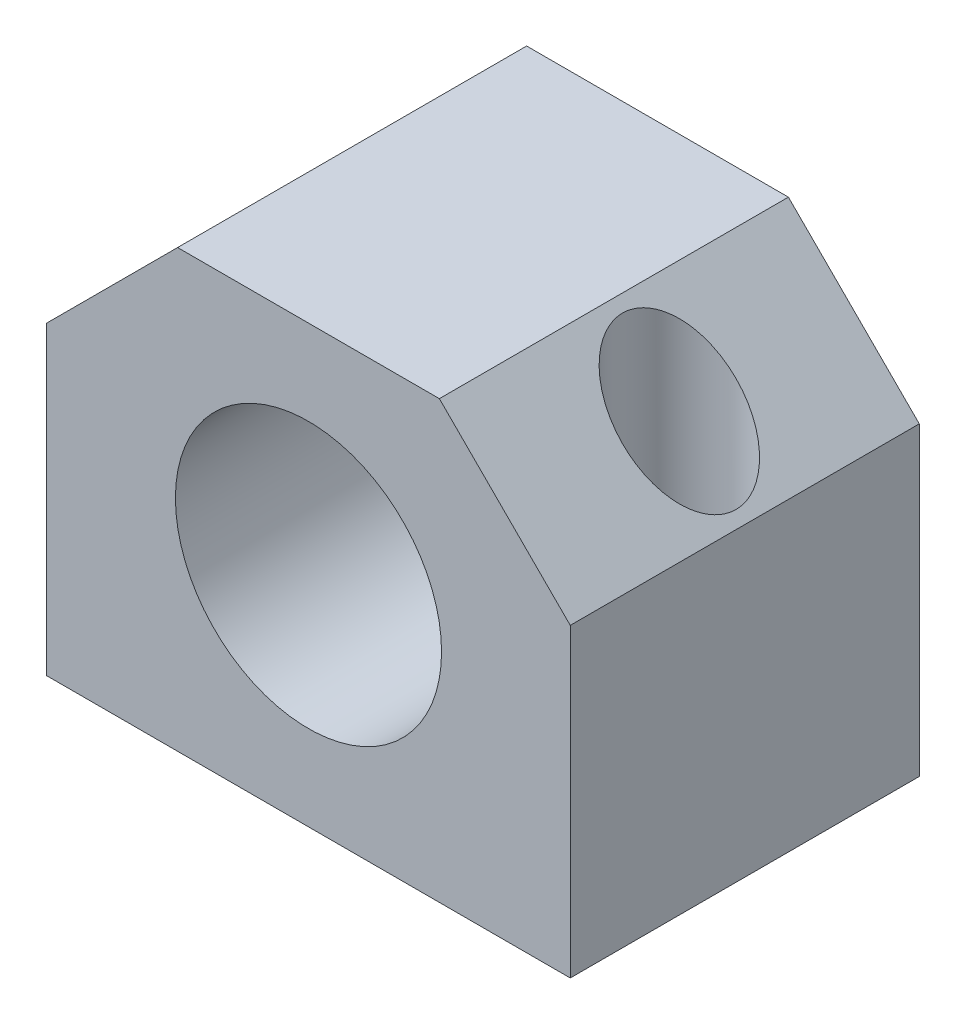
ISO-10303-21;
HEADER;
FILE_DESCRIPTION(('STEP AP214'),'2;1');
FILE_NAME('part.step','',(''),(''),'','','');
FILE_SCHEMA(('AUTOMOTIVE_DESIGN { 1 0 10303 214 1 1 1 1 }'));
ENDSEC;
DATA;
#1=APPLICATION_CONTEXT('core data for automotive mechanical design processes');
#2=APPLICATION_PROTOCOL_DEFINITION('international standard','automotive_design',2000,#1);
#3=PRODUCT_CONTEXT('',#1,'mechanical');
#4=PRODUCT('Part','Part','',(#3));
#5=PRODUCT_RELATED_PRODUCT_CATEGORY('part','',(#4));
#6=PRODUCT_DEFINITION_FORMATION('','',#4);
#7=PRODUCT_DEFINITION_CONTEXT('part definition',#1,'design');
#8=PRODUCT_DEFINITION('design','',#6,#7);
#9=PRODUCT_DEFINITION_SHAPE('','',#8);
#10=(LENGTH_UNIT() NAMED_UNIT(*) SI_UNIT(.MILLI.,.METRE.));
#11=(NAMED_UNIT(*) PLANE_ANGLE_UNIT() SI_UNIT($,.RADIAN.));
#12=(NAMED_UNIT(*) SI_UNIT($,.STERADIAN.) SOLID_ANGLE_UNIT());
#13=UNCERTAINTY_MEASURE_WITH_UNIT(LENGTH_MEASURE(1.E-05),#10,'distance_accuracy_value','');
#14=(GEOMETRIC_REPRESENTATION_CONTEXT(3) GLOBAL_UNCERTAINTY_ASSIGNED_CONTEXT((#13)) GLOBAL_UNIT_ASSIGNED_CONTEXT((#10,
#11,#12)) REPRESENTATION_CONTEXT('',''));
#15=CARTESIAN_POINT('',(0.,0.,0.));
#16=DIRECTION('',(0.,0.,1.));
#17=DIRECTION('',(1.,0.,0.));
#18=AXIS2_PLACEMENT_3D('',#15,#16,#17);
#19=CARTESIAN_POINT('',(-30.,-25.,40.));
#20=DIRECTION('',(0.,0.,1.));
#21=DIRECTION('',(1.,0.,0.));
#22=AXIS2_PLACEMENT_3D('',#19,#20,#21);
#23=PLANE('',#22);
#24=DIRECTION('',(0.,-1.,0.));
#25=VECTOR('',#24,1.);
#26=CARTESIAN_POINT('',(-30.,10.0000000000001,40.));
#27=LINE('',#26,#25);
#28=CARTESIAN_POINT('',(-30.,10.0000000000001,40.));
#29=VERTEX_POINT('',#28);
#30=CARTESIAN_POINT('',(-30.,-25.,40.));
#31=VERTEX_POINT('',#30);
#32=EDGE_CURVE('E128',#29,#31,#27,.T.);
#33=ORIENTED_EDGE('',*,*,#32,.T.);
#34=DIRECTION('',(1.,0.,0.));
#35=VECTOR('',#34,1.);
#36=CARTESIAN_POINT('',(-30.,-25.,40.));
#37=LINE('',#36,#35);
#38=CARTESIAN_POINT('',(30.,-25.,40.));
#39=VERTEX_POINT('',#38);
#40=EDGE_CURVE('E86',#31,#39,#37,.T.);
#41=ORIENTED_EDGE('',*,*,#40,.T.);
#42=DIRECTION('',(0.,1.,0.));
#43=VECTOR('',#42,1.);
#44=CARTESIAN_POINT('',(30.,-25.,40.));
#45=LINE('',#44,#43);
#46=CARTESIAN_POINT('',(30.,10.0000000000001,40.));
#47=VERTEX_POINT('',#46);
#48=EDGE_CURVE('E99',#39,#47,#45,.T.);
#49=ORIENTED_EDGE('',*,*,#48,.T.);
#50=DIRECTION('',(-0.707106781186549,0.707106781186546,0.));
#51=VECTOR('',#50,1.);
#52=CARTESIAN_POINT('',(30.,10.0000000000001,40.));
#53=LINE('',#52,#51);
#54=CARTESIAN_POINT('',(15.,25.,40.));
#55=VERTEX_POINT('',#54);
#56=EDGE_CURVE('E93',#47,#55,#53,.T.);
#57=ORIENTED_EDGE('',*,*,#56,.T.);
#58=DIRECTION('',(-1.,0.,0.));
#59=VECTOR('',#58,1.);
#60=CARTESIAN_POINT('',(15.,25.,40.));
#61=LINE('',#60,#59);
#62=CARTESIAN_POINT('',(-15.,25.,40.));
#63=VERTEX_POINT('',#62);
#64=EDGE_CURVE('E97',#55,#63,#61,.T.);
#65=ORIENTED_EDGE('',*,*,#64,.T.);
#66=DIRECTION('',(-0.707106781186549,-0.707106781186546,0.));
#67=VECTOR('',#66,1.);
#68=CARTESIAN_POINT('',(-15.,25.,40.));
#69=LINE('',#68,#67);
#70=EDGE_CURVE('E49',#63,#29,#69,.T.);
#71=ORIENTED_EDGE('',*,*,#70,.T.);
#72=EDGE_LOOP('',(#33,#41,#49,#57,#65,#71));
#73=FACE_BOUND('',#72,.T.);
#74=CARTESIAN_POINT('',(0.,0.,40.));
#75=DIRECTION('',(0.,0.,1.));
#76=DIRECTION('',(1.,0.,0.));
#77=AXIS2_PLACEMENT_3D('',#74,#75,#76);
#78=CIRCLE('',#77,15.25);
#79=CARTESIAN_POINT('',(15.25,0.,40.));
#80=VERTEX_POINT('',#79);
#81=EDGE_CURVE('E121',#80,#80,#78,.T.);
#82=ORIENTED_EDGE('',*,*,#81,.F.);
#83=EDGE_LOOP('',(#82));
#84=FACE_BOUND('',#83,.T.);
#85=ADVANCED_FACE('F30',(#73,#84),#23,.T.);
#86=CARTESIAN_POINT('',(-30.,-25.,0.));
#87=DIRECTION('',(0.,0.,1.));
#88=DIRECTION('',(1.,0.,0.));
#89=AXIS2_PLACEMENT_3D('',#86,#87,#88);
#90=PLANE('',#89);
#91=DIRECTION('',(0.,-1.,0.));
#92=VECTOR('',#91,1.);
#93=CARTESIAN_POINT('',(-30.,10.0000000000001,0.));
#94=LINE('',#93,#92);
#95=CARTESIAN_POINT('',(-30.,10.0000000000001,0.));
#96=VERTEX_POINT('',#95);
#97=CARTESIAN_POINT('',(-30.,-25.,0.));
#98=VERTEX_POINT('',#97);
#99=EDGE_CURVE('E117',#96,#98,#94,.T.);
#100=ORIENTED_EDGE('',*,*,#99,.F.);
#101=DIRECTION('',(-0.707106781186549,-0.707106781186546,0.));
#102=VECTOR('',#101,1.);
#103=CARTESIAN_POINT('',(-15.,25.,0.));
#104=LINE('',#103,#102);
#105=CARTESIAN_POINT('',(-15.,25.,0.));
#106=VERTEX_POINT('',#105);
#107=EDGE_CURVE('E78',#106,#96,#104,.T.);
#108=ORIENTED_EDGE('',*,*,#107,.F.);
#109=DIRECTION('',(-1.,0.,0.));
#110=VECTOR('',#109,1.);
#111=CARTESIAN_POINT('',(15.,25.,0.));
#112=LINE('',#111,#110);
#113=CARTESIAN_POINT('',(15.,25.,0.));
#114=VERTEX_POINT('',#113);
#115=EDGE_CURVE('E72',#114,#106,#112,.T.);
#116=ORIENTED_EDGE('',*,*,#115,.F.);
#117=DIRECTION('',(-0.707106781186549,0.707106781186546,0.));
#118=VECTOR('',#117,1.);
#119=CARTESIAN_POINT('',(30.,10.0000000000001,0.));
#120=LINE('',#119,#118);
#121=CARTESIAN_POINT('',(30.,10.0000000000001,0.));
#122=VERTEX_POINT('',#121);
#123=EDGE_CURVE('E107',#122,#114,#120,.T.);
#124=ORIENTED_EDGE('',*,*,#123,.F.);
#125=DIRECTION('',(0.,1.,0.));
#126=VECTOR('',#125,1.);
#127=CARTESIAN_POINT('',(30.,-25.,0.));
#128=LINE('',#127,#126);
#129=CARTESIAN_POINT('',(30.,-25.,0.));
#130=VERTEX_POINT('',#129);
#131=EDGE_CURVE('E123',#130,#122,#128,.T.);
#132=ORIENTED_EDGE('',*,*,#131,.F.);
#133=DIRECTION('',(1.,0.,0.));
#134=VECTOR('',#133,1.);
#135=CARTESIAN_POINT('',(-30.,-25.,0.));
#136=LINE('',#135,#134);
#137=EDGE_CURVE('E120',#98,#130,#136,.T.);
#138=ORIENTED_EDGE('',*,*,#137,.F.);
#139=EDGE_LOOP('',(#100,#108,#116,#124,#132,#138));
#140=FACE_BOUND('',#139,.T.);
#141=CARTESIAN_POINT('',(0.,0.,0.));
#142=DIRECTION('',(0.,0.,1.));
#143=DIRECTION('',(1.,0.,0.));
#144=AXIS2_PLACEMENT_3D('',#141,#142,#143);
#145=CIRCLE('',#144,15.25);
#146=CARTESIAN_POINT('',(15.25,0.,0.));
#147=VERTEX_POINT('',#146);
#148=EDGE_CURVE('E135',#147,#147,#145,.T.);
#149=ORIENTED_EDGE('',*,*,#148,.T.);
#150=EDGE_LOOP('',(#149));
#151=FACE_BOUND('',#150,.T.);
#152=ADVANCED_FACE('F162',(#140,#151),#90,.F.);
#153=CARTESIAN_POINT('',(-30.,10.0000000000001,40.));
#154=DIRECTION('',(1.,0.,0.));
#155=DIRECTION('',(0.,0.,-1.));
#156=AXIS2_PLACEMENT_3D('',#153,#154,#155);
#157=PLANE('',#156);
#158=ORIENTED_EDGE('',*,*,#99,.T.);
#159=DIRECTION('',(0.,0.,-1.));
#160=VECTOR('',#159,1.);
#161=CARTESIAN_POINT('',(-30.,-25.,40.));
#162=LINE('',#161,#160);
#163=EDGE_CURVE('E11',#31,#98,#162,.T.);
#164=ORIENTED_EDGE('',*,*,#163,.F.);
#165=ORIENTED_EDGE('',*,*,#32,.F.);
#166=DIRECTION('',(0.,0.,-1.));
#167=VECTOR('',#166,1.);
#168=CARTESIAN_POINT('',(-30.,10.0000000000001,40.));
#169=LINE('',#168,#167);
#170=EDGE_CURVE('E113',#29,#96,#169,.T.);
#171=ORIENTED_EDGE('',*,*,#170,.T.);
#172=EDGE_LOOP('',(#158,#164,#165,#171));
#173=FACE_BOUND('',#172,.T.);
#174=ADVANCED_FACE('F32',(#173),#157,.F.);
#175=CARTESIAN_POINT('',(-30.,-25.,40.));
#176=DIRECTION('',(0.,1.,0.));
#177=DIRECTION('',(-1.,0.,0.));
#178=AXIS2_PLACEMENT_3D('',#175,#176,#177);
#179=PLANE('',#178);
#180=CARTESIAN_POINT('',(22.5,-25.,20.));
#181=DIRECTION('',(0.,1.,0.));
#182=DIRECTION('',(0.,0.,1.));
#183=AXIS2_PLACEMENT_3D('',#180,#181,#182);
#184=CIRCLE('',#183,3.25);
#185=CARTESIAN_POINT('',(22.5,-25.,23.25));
#186=VERTEX_POINT('',#185);
#187=EDGE_CURVE('E215',#186,#186,#184,.T.);
#188=ORIENTED_EDGE('',*,*,#187,.T.);
#189=EDGE_LOOP('',(#188));
#190=FACE_BOUND('',#189,.T.);
#191=CARTESIAN_POINT('',(-22.5,-25.,20.));
#192=DIRECTION('',(0.,1.,0.));
#193=DIRECTION('',(0.,0.,1.));
#194=AXIS2_PLACEMENT_3D('',#191,#192,#193);
#195=CIRCLE('',#194,3.25);
#196=CARTESIAN_POINT('',(-22.5,-25.,23.25));
#197=VERTEX_POINT('',#196);
#198=EDGE_CURVE('E136',#197,#197,#195,.T.);
#199=ORIENTED_EDGE('',*,*,#198,.T.);
#200=EDGE_LOOP('',(#199));
#201=FACE_BOUND('',#200,.T.);
#202=ORIENTED_EDGE('',*,*,#137,.T.);
#203=DIRECTION('',(0.,0.,-1.));
#204=VECTOR('',#203,1.);
#205=CARTESIAN_POINT('',(30.,-25.,40.));
#206=LINE('',#205,#204);
#207=EDGE_CURVE('E40',#39,#130,#206,.T.);
#208=ORIENTED_EDGE('',*,*,#207,.F.);
#209=ORIENTED_EDGE('',*,*,#40,.F.);
#210=ORIENTED_EDGE('',*,*,#163,.T.);
#211=EDGE_LOOP('',(#202,#208,#209,#210));
#212=FACE_BOUND('',#211,.T.);
#213=ADVANCED_FACE('F156',(#190,#201,#212),#179,.F.);
#214=CARTESIAN_POINT('',(30.,-25.,40.));
#215=DIRECTION('',(-1.,0.,0.));
#216=DIRECTION('',(0.,-1.,0.));
#217=AXIS2_PLACEMENT_3D('',#214,#215,#216);
#218=PLANE('',#217);
#219=ORIENTED_EDGE('',*,*,#131,.T.);
#220=DIRECTION('',(0.,0.,-1.));
#221=VECTOR('',#220,1.);
#222=CARTESIAN_POINT('',(30.,10.0000000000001,40.));
#223=LINE('',#222,#221);
#224=EDGE_CURVE('E108',#47,#122,#223,.T.);
#225=ORIENTED_EDGE('',*,*,#224,.F.);
#226=ORIENTED_EDGE('',*,*,#48,.F.);
#227=ORIENTED_EDGE('',*,*,#207,.T.);
#228=EDGE_LOOP('',(#219,#225,#226,#227));
#229=FACE_BOUND('',#228,.T.);
#230=ADVANCED_FACE('F159',(#229),#218,.F.);
#231=CARTESIAN_POINT('',(30.,10.0000000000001,40.));
#232=DIRECTION('',(-0.707106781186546,-0.707106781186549,0.));
#233=DIRECTION('',(0.707106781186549,-0.707106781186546,0.));
#234=AXIS2_PLACEMENT_3D('',#231,#232,#233);
#235=PLANE('',#234);
#236=CARTESIAN_POINT('',(22.5,17.5,20.));
#237=DIRECTION('',(-0.707106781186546,-0.707106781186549,0.));
#238=DIRECTION('',(-0.707106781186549,0.707106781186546,0.));
#239=AXIS2_PLACEMENT_3D('',#236,#237,#238);
#240=ELLIPSE('',#239,9.1923881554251,6.5);
#241=CARTESIAN_POINT('',(16.,24.,20.));
#242=VERTEX_POINT('',#241);
#243=EDGE_CURVE('E34',#242,#242,#240,.T.);
#244=ORIENTED_EDGE('',*,*,#243,.T.);
#245=EDGE_LOOP('',(#244));
#246=FACE_BOUND('',#245,.T.);
#247=ORIENTED_EDGE('',*,*,#123,.T.);
#248=DIRECTION('',(0.,0.,-1.));
#249=VECTOR('',#248,1.);
#250=CARTESIAN_POINT('',(15.,25.,40.));
#251=LINE('',#250,#249);
#252=EDGE_CURVE('E104',#55,#114,#251,.T.);
#253=ORIENTED_EDGE('',*,*,#252,.F.);
#254=ORIENTED_EDGE('',*,*,#56,.F.);
#255=ORIENTED_EDGE('',*,*,#224,.T.);
#256=EDGE_LOOP('',(#247,#253,#254,#255));
#257=FACE_BOUND('',#256,.T.);
#258=ADVANCED_FACE('F105',(#246,#257),#235,.F.);
#259=CARTESIAN_POINT('',(15.,25.,40.));
#260=DIRECTION('',(0.,-1.,0.));
#261=DIRECTION('',(0.,0.,-1.));
#262=AXIS2_PLACEMENT_3D('',#259,#260,#261);
#263=PLANE('',#262);
#264=ORIENTED_EDGE('',*,*,#115,.T.);
#265=DIRECTION('',(0.,0.,-1.));
#266=VECTOR('',#265,1.);
#267=CARTESIAN_POINT('',(-15.,25.,40.));
#268=LINE('',#267,#266);
#269=EDGE_CURVE('E109',#63,#106,#268,.T.);
#270=ORIENTED_EDGE('',*,*,#269,.F.);
#271=ORIENTED_EDGE('',*,*,#64,.F.);
#272=ORIENTED_EDGE('',*,*,#252,.T.);
#273=EDGE_LOOP('',(#264,#270,#271,#272));
#274=FACE_BOUND('',#273,.T.);
#275=ADVANCED_FACE('F111',(#274),#263,.F.);
#276=CARTESIAN_POINT('',(-15.,25.,40.));
#277=DIRECTION('',(0.707106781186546,-0.707106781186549,0.));
#278=DIRECTION('',(0.707106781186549,0.707106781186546,0.));
#279=AXIS2_PLACEMENT_3D('',#276,#277,#278);
#280=PLANE('',#279);
#281=CARTESIAN_POINT('',(-22.5,17.5,20.));
#282=DIRECTION('',(0.707106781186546,-0.707106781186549,0.));
#283=DIRECTION('',(0.707106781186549,0.707106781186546,0.));
#284=AXIS2_PLACEMENT_3D('',#281,#282,#283);
#285=ELLIPSE('',#284,9.19238815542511,6.5);
#286=CARTESIAN_POINT('',(-16.,24.,20.));
#287=VERTEX_POINT('',#286);
#288=EDGE_CURVE('E133',#287,#287,#285,.T.);
#289=ORIENTED_EDGE('',*,*,#288,.T.);
#290=EDGE_LOOP('',(#289));
#291=FACE_BOUND('',#290,.T.);
#292=ORIENTED_EDGE('',*,*,#107,.T.);
#293=ORIENTED_EDGE('',*,*,#170,.F.);
#294=ORIENTED_EDGE('',*,*,#70,.F.);
#295=ORIENTED_EDGE('',*,*,#269,.T.);
#296=EDGE_LOOP('',(#292,#293,#294,#295));
#297=FACE_BOUND('',#296,.T.);
#298=ADVANCED_FACE('F165',(#291,#297),#280,.F.);
#299=CARTESIAN_POINT('',(0.,0.,40.));
#300=DIRECTION('',(0.,0.,-1.));
#301=DIRECTION('',(-1.,0.,0.));
#302=AXIS2_PLACEMENT_3D('',#299,#300,#301);
#303=CYLINDRICAL_SURFACE('',#302,15.25);
#304=ORIENTED_EDGE('',*,*,#81,.T.);
#305=EDGE_LOOP('',(#304));
#306=FACE_BOUND('',#305,.T.);
#307=ORIENTED_EDGE('',*,*,#148,.F.);
#308=EDGE_LOOP('',(#307));
#309=FACE_BOUND('',#308,.T.);
#310=ADVANCED_FACE('F167',(#306,#309),#303,.F.);
#311=CARTESIAN_POINT('',(-22.5,25.,20.));
#312=DIRECTION('',(0.,1.,0.));
#313=DIRECTION('',(0.,0.,1.));
#314=AXIS2_PLACEMENT_3D('',#311,#312,#313);
#315=CYLINDRICAL_SURFACE('',#314,6.5);
#316=CARTESIAN_POINT('',(-22.5,-5.,20.));
#317=DIRECTION('',(0.,1.,0.));
#318=DIRECTION('',(0.,0.,1.));
#319=AXIS2_PLACEMENT_3D('',#316,#317,#318);
#320=CIRCLE('',#319,6.5);
#321=CARTESIAN_POINT('',(-22.5,-5.,26.5));
#322=VERTEX_POINT('',#321);
#323=EDGE_CURVE('E147',#322,#322,#320,.T.);
#324=ORIENTED_EDGE('',*,*,#323,.F.);
#325=EDGE_LOOP('',(#324));
#326=FACE_BOUND('',#325,.T.);
#327=ORIENTED_EDGE('',*,*,#288,.F.);
#328=EDGE_LOOP('',(#327));
#329=FACE_BOUND('',#328,.T.);
#330=ADVANCED_FACE('F173',(#326,#329),#315,.F.);
#331=CARTESIAN_POINT('',(-22.5,25.,20.));
#332=DIRECTION('',(0.,1.,0.));
#333=DIRECTION('',(0.,0.,1.));
#334=AXIS2_PLACEMENT_3D('',#331,#332,#333);
#335=CYLINDRICAL_SURFACE('',#334,3.25);
#336=ORIENTED_EDGE('',*,*,#198,.F.);
#337=EDGE_LOOP('',(#336));
#338=FACE_BOUND('',#337,.T.);
#339=CARTESIAN_POINT('',(-22.5,-5.,20.));
#340=DIRECTION('',(0.,1.,0.));
#341=DIRECTION('',(0.,0.,1.));
#342=AXIS2_PLACEMENT_3D('',#339,#340,#341);
#343=CIRCLE('',#342,3.25);
#344=CARTESIAN_POINT('',(-22.5,-5.,23.25));
#345=VERTEX_POINT('',#344);
#346=EDGE_CURVE('E142',#345,#345,#343,.T.);
#347=ORIENTED_EDGE('',*,*,#346,.T.);
#348=EDGE_LOOP('',(#347));
#349=FACE_BOUND('',#348,.T.);
#350=ADVANCED_FACE('F184',(#338,#349),#335,.F.);
#351=CARTESIAN_POINT('',(-19.25,-5.,20.));
#352=DIRECTION('',(0.,-1.,0.));
#353=DIRECTION('',(0.,0.,-1.));
#354=AXIS2_PLACEMENT_3D('',#351,#352,#353);
#355=PLANE('',#354);
#356=ORIENTED_EDGE('',*,*,#346,.F.);
#357=EDGE_LOOP('',(#356));
#358=FACE_BOUND('',#357,.T.);
#359=ORIENTED_EDGE('',*,*,#323,.T.);
#360=EDGE_LOOP('',(#359));
#361=FACE_BOUND('',#360,.T.);
#362=ADVANCED_FACE('F187',(#358,#361),#355,.F.);
#363=CARTESIAN_POINT('',(22.5,25.,20.));
#364=DIRECTION('',(0.,1.,0.));
#365=DIRECTION('',(0.,0.,1.));
#366=AXIS2_PLACEMENT_3D('',#363,#364,#365);
#367=CYLINDRICAL_SURFACE('',#366,6.5);
#368=CARTESIAN_POINT('',(22.5,-5.,20.));
#369=DIRECTION('',(0.,1.,0.));
#370=DIRECTION('',(0.,0.,1.));
#371=AXIS2_PLACEMENT_3D('',#368,#369,#370);
#372=CIRCLE('',#371,6.5);
#373=CARTESIAN_POINT('',(22.5,-5.,26.5));
#374=VERTEX_POINT('',#373);
#375=EDGE_CURVE('E211',#374,#374,#372,.T.);
#376=ORIENTED_EDGE('',*,*,#375,.F.);
#377=EDGE_LOOP('',(#376));
#378=FACE_BOUND('',#377,.T.);
#379=ORIENTED_EDGE('',*,*,#243,.F.);
#380=EDGE_LOOP('',(#379));
#381=FACE_BOUND('',#380,.T.);
#382=ADVANCED_FACE('F191',(#378,#381),#367,.F.);
#383=CARTESIAN_POINT('',(22.5,25.,20.));
#384=DIRECTION('',(0.,1.,0.));
#385=DIRECTION('',(0.,0.,1.));
#386=AXIS2_PLACEMENT_3D('',#383,#384,#385);
#387=CYLINDRICAL_SURFACE('',#386,3.25);
#388=ORIENTED_EDGE('',*,*,#187,.F.);
#389=EDGE_LOOP('',(#388));
#390=FACE_BOUND('',#389,.T.);
#391=CARTESIAN_POINT('',(22.5,-5.,20.));
#392=DIRECTION('',(0.,1.,0.));
#393=DIRECTION('',(0.,0.,1.));
#394=AXIS2_PLACEMENT_3D('',#391,#392,#393);
#395=CIRCLE('',#394,3.25);
#396=CARTESIAN_POINT('',(22.5,-5.,23.25));
#397=VERTEX_POINT('',#396);
#398=EDGE_CURVE('E218',#397,#397,#395,.T.);
#399=ORIENTED_EDGE('',*,*,#398,.T.);
#400=EDGE_LOOP('',(#399));
#401=FACE_BOUND('',#400,.T.);
#402=ADVANCED_FACE('F196',(#390,#401),#387,.F.);
#403=CARTESIAN_POINT('',(25.75,-5.,20.));
#404=DIRECTION('',(0.,-1.,0.));
#405=DIRECTION('',(0.,0.,-1.));
#406=AXIS2_PLACEMENT_3D('',#403,#404,#405);
#407=PLANE('',#406);
#408=ORIENTED_EDGE('',*,*,#398,.F.);
#409=EDGE_LOOP('',(#408));
#410=FACE_BOUND('',#409,.T.);
#411=ORIENTED_EDGE('',*,*,#375,.T.);
#412=EDGE_LOOP('',(#411));
#413=FACE_BOUND('',#412,.T.);
#414=ADVANCED_FACE('F199',(#410,#413),#407,.F.);
#415=CLOSED_SHELL('',(#85,#152,#174,#213,#230,#258,#275,#298,#310,#330,#350,#362,#382,#402,#414));
#416=MANIFOLD_SOLID_BREP('B2',#415);
#417=ADVANCED_BREP_SHAPE_REPRESENTATION('',(#18,#416),#14);
#418=SHAPE_DEFINITION_REPRESENTATION(#9,#417);
ENDSEC;
END-ISO-10303-21;
